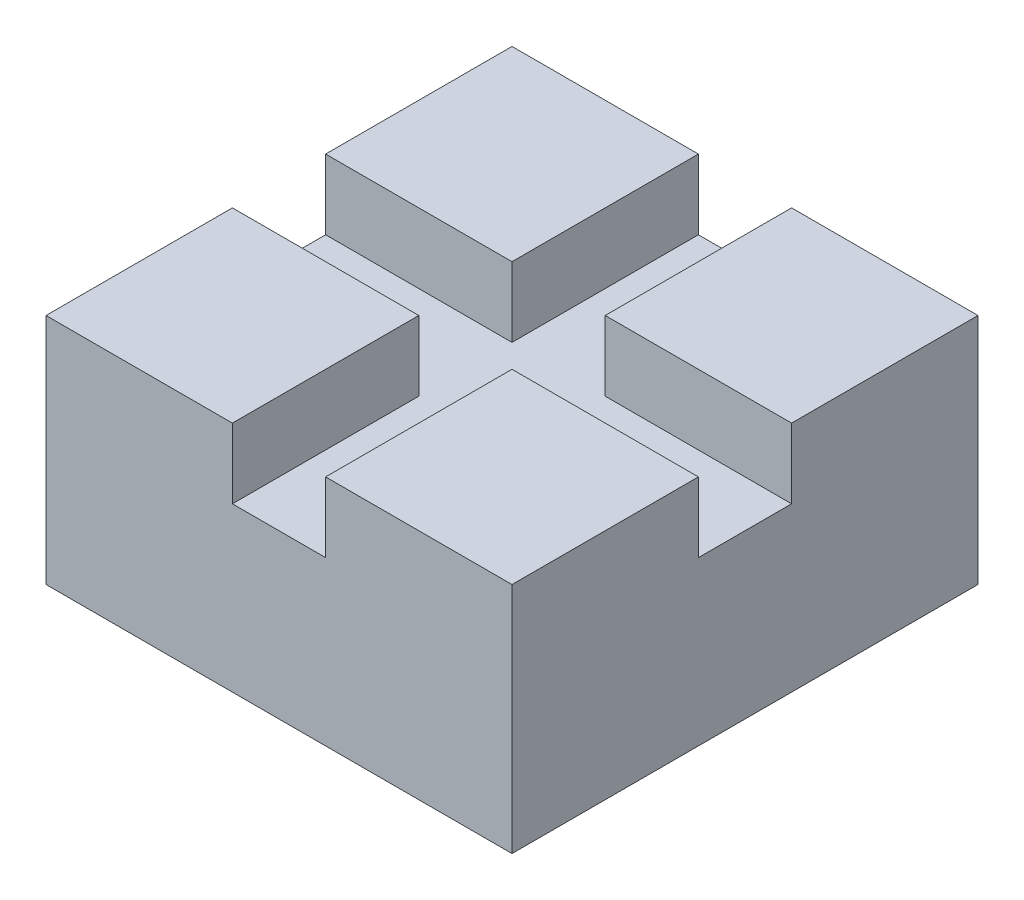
from build123d import *

# Parameters (mm, degrees)
SKETCH_1_W          = 80
SKETCH_1_H          = 80
EXTRUDE_1_DEPTH     = 40
CUT_EXTRUDE_1_DEPTH = 12


with BuildPart() as part:
    # Sketch 1 → Extrude 1 (new body)
    with BuildSketch(Plane(origin=(0, 0, 0), x_dir=(1, 0, 0), z_dir=(0, 1, 0))):
        Rectangle(SKETCH_1_W, SKETCH_1_H)
    extrude(amount=EXTRUDE_1_DEPTH)

    # Sketch 2 → Cut-Extrude 1 (cut)
    with BuildSketch(Plane(origin=(0, 40, 0), x_dir=(1, 0, 0), z_dir=(0, 1, 0))):
        Polygon((8, 8), (40, 8), (40, -8), (8, -8), (8, -40), (-8, -40), (-8, -8), (-40, -8), (-40, 8), (-8, 8), (-8, 40), (8, 40), align=None)
    extrude(amount=-CUT_EXTRUDE_1_DEPTH, mode=Mode.SUBTRACT)


solid = part.part
